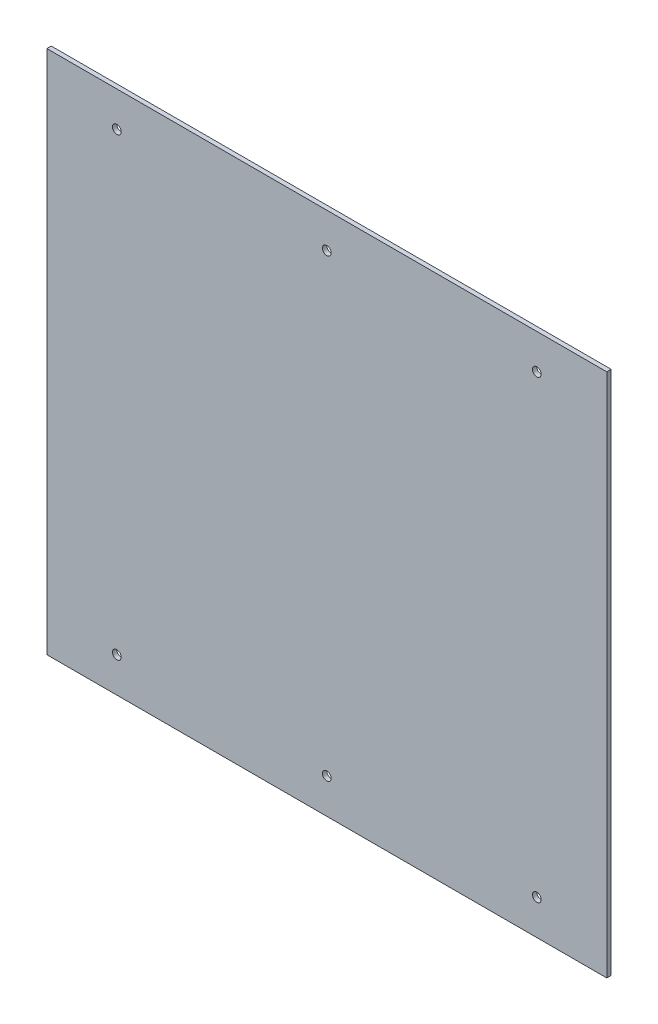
ISO-10303-21;
HEADER;
FILE_DESCRIPTION(('STEP AP214'),'2;1');
FILE_NAME('part.step','',(''),(''),'','','');
FILE_SCHEMA(('AUTOMOTIVE_DESIGN { 1 0 10303 214 1 1 1 1 }'));
ENDSEC;
DATA;
#1=APPLICATION_CONTEXT('core data for automotive mechanical design processes');
#2=APPLICATION_PROTOCOL_DEFINITION('international standard','automotive_design',2000,#1);
#3=PRODUCT_CONTEXT('',#1,'mechanical');
#4=PRODUCT('Part','Part','',(#3));
#5=PRODUCT_RELATED_PRODUCT_CATEGORY('part','',(#4));
#6=PRODUCT_DEFINITION_FORMATION('','',#4);
#7=PRODUCT_DEFINITION_CONTEXT('part definition',#1,'design');
#8=PRODUCT_DEFINITION('design','',#6,#7);
#9=PRODUCT_DEFINITION_SHAPE('','',#8);
#10=(LENGTH_UNIT() NAMED_UNIT(*) SI_UNIT(.MILLI.,.METRE.));
#11=(NAMED_UNIT(*) PLANE_ANGLE_UNIT() SI_UNIT($,.RADIAN.));
#12=(NAMED_UNIT(*) SI_UNIT($,.STERADIAN.) SOLID_ANGLE_UNIT());
#13=UNCERTAINTY_MEASURE_WITH_UNIT(LENGTH_MEASURE(1.E-05),#10,'distance_accuracy_value','');
#14=(GEOMETRIC_REPRESENTATION_CONTEXT(3) GLOBAL_UNCERTAINTY_ASSIGNED_CONTEXT((#13)) GLOBAL_UNIT_ASSIGNED_CONTEXT((#10,
#11,#12)) REPRESENTATION_CONTEXT('',''));
#15=CARTESIAN_POINT('',(0.,0.,0.));
#16=DIRECTION('',(0.,0.,1.));
#17=DIRECTION('',(1.,0.,0.));
#18=AXIS2_PLACEMENT_3D('',#15,#16,#17);
#19=CARTESIAN_POINT('',(0.,0.,1.5875));
#20=DIRECTION('',(0.,0.,1.));
#21=DIRECTION('',(1.,0.,0.));
#22=AXIS2_PLACEMENT_3D('',#19,#20,#21);
#23=PLANE('',#22);
#24=CARTESIAN_POINT('',(0.,76.2,1.5875));
#25=DIRECTION('',(0.,0.,1.));
#26=DIRECTION('',(1.,0.,0.));
#27=AXIS2_PLACEMENT_3D('',#24,#25,#26);
#28=CIRCLE('',#27,1.5875);
#29=CARTESIAN_POINT('',(1.5875,76.2,1.5875));
#30=VERTEX_POINT('',#29);
#31=EDGE_CURVE('E133',#30,#30,#28,.T.);
#32=ORIENTED_EDGE('',*,*,#31,.F.);
#33=EDGE_LOOP('',(#32));
#34=FACE_BOUND('',#33,.T.);
#35=CARTESIAN_POINT('',(-76.2,-88.9,1.5875));
#36=DIRECTION('',(0.,0.,1.));
#37=DIRECTION('',(1.,0.,0.));
#38=AXIS2_PLACEMENT_3D('',#35,#36,#37);
#39=CIRCLE('',#38,1.5875);
#40=CARTESIAN_POINT('',(-74.6125,-88.9,1.5875));
#41=VERTEX_POINT('',#40);
#42=EDGE_CURVE('E121',#41,#41,#39,.T.);
#43=ORIENTED_EDGE('',*,*,#42,.F.);
#44=EDGE_LOOP('',(#43));
#45=FACE_BOUND('',#44,.T.);
#46=CARTESIAN_POINT('',(76.2,-88.9,1.5875));
#47=DIRECTION('',(0.,0.,1.));
#48=DIRECTION('',(1.,0.,0.));
#49=AXIS2_PLACEMENT_3D('',#46,#47,#48);
#50=CIRCLE('',#49,1.58749999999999);
#51=CARTESIAN_POINT('',(77.7875,-88.9,1.5875));
#52=VERTEX_POINT('',#51);
#53=EDGE_CURVE('E100',#52,#52,#50,.T.);
#54=ORIENTED_EDGE('',*,*,#53,.F.);
#55=EDGE_LOOP('',(#54));
#56=FACE_BOUND('',#55,.T.);
#57=DIRECTION('',(0.,-1.,0.));
#58=VECTOR('',#57,1.);
#59=CARTESIAN_POINT('',(-101.6,-101.6,1.5875));
#60=LINE('',#59,#58);
#61=CARTESIAN_POINT('',(-101.6,88.9,1.5875));
#62=VERTEX_POINT('',#61);
#63=CARTESIAN_POINT('',(-101.6,-101.6,1.5875));
#64=VERTEX_POINT('',#63);
#65=EDGE_CURVE('E85',#62,#64,#60,.T.);
#66=ORIENTED_EDGE('',*,*,#65,.T.);
#67=DIRECTION('',(1.,0.,0.));
#68=VECTOR('',#67,1.);
#69=CARTESIAN_POINT('',(101.6,-101.6,1.5875));
#70=LINE('',#69,#68);
#71=CARTESIAN_POINT('',(101.6,-101.6,1.5875));
#72=VERTEX_POINT('',#71);
#73=EDGE_CURVE('E80',#64,#72,#70,.T.);
#74=ORIENTED_EDGE('',*,*,#73,.T.);
#75=DIRECTION('',(0.,1.,0.));
#76=VECTOR('',#75,1.);
#77=CARTESIAN_POINT('',(101.6,-101.6,1.5875));
#78=LINE('',#77,#76);
#79=CARTESIAN_POINT('',(101.6,88.9,1.5875));
#80=VERTEX_POINT('',#79);
#81=EDGE_CURVE('E83',#72,#80,#78,.T.);
#82=ORIENTED_EDGE('',*,*,#81,.T.);
#83=DIRECTION('',(-1.,0.,0.));
#84=VECTOR('',#83,1.);
#85=CARTESIAN_POINT('',(101.6,88.9,1.5875));
#86=LINE('',#85,#84);
#87=EDGE_CURVE('E50',#80,#62,#86,.T.);
#88=ORIENTED_EDGE('',*,*,#87,.T.);
#89=EDGE_LOOP('',(#66,#74,#82,#88));
#90=FACE_BOUND('',#89,.T.);
#91=CARTESIAN_POINT('',(0.,-88.9,1.5875));
#92=DIRECTION('',(0.,0.,1.));
#93=DIRECTION('',(1.,0.,0.));
#94=AXIS2_PLACEMENT_3D('',#91,#92,#93);
#95=CIRCLE('',#94,1.5875);
#96=CARTESIAN_POINT('',(1.58750000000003,-88.9,1.5875));
#97=VERTEX_POINT('',#96);
#98=EDGE_CURVE('E115',#97,#97,#95,.T.);
#99=ORIENTED_EDGE('',*,*,#98,.F.);
#100=EDGE_LOOP('',(#99));
#101=FACE_BOUND('',#100,.T.);
#102=CARTESIAN_POINT('',(-76.2,76.1999999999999,1.5875));
#103=DIRECTION('',(0.,0.,1.));
#104=DIRECTION('',(1.,0.,0.));
#105=AXIS2_PLACEMENT_3D('',#102,#103,#104);
#106=CIRCLE('',#105,1.58749999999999);
#107=CARTESIAN_POINT('',(-74.6125,76.1999999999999,1.5875));
#108=VERTEX_POINT('',#107);
#109=EDGE_CURVE('E127',#108,#108,#106,.T.);
#110=ORIENTED_EDGE('',*,*,#109,.F.);
#111=EDGE_LOOP('',(#110));
#112=FACE_BOUND('',#111,.T.);
#113=CARTESIAN_POINT('',(76.2,76.2,1.5875));
#114=DIRECTION('',(0.,0.,1.));
#115=DIRECTION('',(1.,0.,0.));
#116=AXIS2_PLACEMENT_3D('',#113,#114,#115);
#117=CIRCLE('',#116,1.58749999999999);
#118=CARTESIAN_POINT('',(77.7875,76.2,1.5875));
#119=VERTEX_POINT('',#118);
#120=EDGE_CURVE('E139',#119,#119,#117,.T.);
#121=ORIENTED_EDGE('',*,*,#120,.F.);
#122=EDGE_LOOP('',(#121));
#123=FACE_BOUND('',#122,.T.);
#124=ADVANCED_FACE('F33',(#34,#45,#56,#90,#101,#112,#123),#23,.T.);
#125=CARTESIAN_POINT('',(0.,0.,0.));
#126=DIRECTION('',(0.,0.,1.));
#127=DIRECTION('',(1.,0.,0.));
#128=AXIS2_PLACEMENT_3D('',#125,#126,#127);
#129=PLANE('',#128);
#130=DIRECTION('',(0.,-1.,0.));
#131=VECTOR('',#130,1.);
#132=CARTESIAN_POINT('',(-101.6,-101.6,0.));
#133=LINE('',#132,#131);
#134=CARTESIAN_POINT('',(-101.6,88.9,0.));
#135=VERTEX_POINT('',#134);
#136=CARTESIAN_POINT('',(-101.6,-101.6,0.));
#137=VERTEX_POINT('',#136);
#138=EDGE_CURVE('E97',#135,#137,#133,.T.);
#139=ORIENTED_EDGE('',*,*,#138,.F.);
#140=DIRECTION('',(-1.,0.,0.));
#141=VECTOR('',#140,1.);
#142=CARTESIAN_POINT('',(101.6,88.9,0.));
#143=LINE('',#142,#141);
#144=CARTESIAN_POINT('',(101.6,88.9,0.));
#145=VERTEX_POINT('',#144);
#146=EDGE_CURVE('E73',#145,#135,#143,.T.);
#147=ORIENTED_EDGE('',*,*,#146,.F.);
#148=DIRECTION('',(0.,1.,0.));
#149=VECTOR('',#148,1.);
#150=CARTESIAN_POINT('',(101.6,-101.6,0.));
#151=LINE('',#150,#149);
#152=CARTESIAN_POINT('',(101.6,-101.6,0.));
#153=VERTEX_POINT('',#152);
#154=EDGE_CURVE('E67',#153,#145,#151,.T.);
#155=ORIENTED_EDGE('',*,*,#154,.F.);
#156=DIRECTION('',(1.,0.,0.));
#157=VECTOR('',#156,1.);
#158=CARTESIAN_POINT('',(101.6,-101.6,0.));
#159=LINE('',#158,#157);
#160=EDGE_CURVE('E89',#137,#153,#159,.T.);
#161=ORIENTED_EDGE('',*,*,#160,.F.);
#162=EDGE_LOOP('',(#139,#147,#155,#161));
#163=FACE_BOUND('',#162,.T.);
#164=CARTESIAN_POINT('',(76.2,-88.9,0.));
#165=DIRECTION('',(0.,0.,1.));
#166=DIRECTION('',(1.,0.,0.));
#167=AXIS2_PLACEMENT_3D('',#164,#165,#166);
#168=CIRCLE('',#167,1.58749999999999);
#169=CARTESIAN_POINT('',(77.7875,-88.9,0.));
#170=VERTEX_POINT('',#169);
#171=EDGE_CURVE('E112',#170,#170,#168,.T.);
#172=ORIENTED_EDGE('',*,*,#171,.T.);
#173=EDGE_LOOP('',(#172));
#174=FACE_BOUND('',#173,.T.);
#175=CARTESIAN_POINT('',(0.,-88.9,0.));
#176=DIRECTION('',(0.,0.,1.));
#177=DIRECTION('',(1.,0.,0.));
#178=AXIS2_PLACEMENT_3D('',#175,#176,#177);
#179=CIRCLE('',#178,1.5875);
#180=CARTESIAN_POINT('',(1.58750000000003,-88.9,0.));
#181=VERTEX_POINT('',#180);
#182=EDGE_CURVE('E118',#181,#181,#179,.T.);
#183=ORIENTED_EDGE('',*,*,#182,.T.);
#184=EDGE_LOOP('',(#183));
#185=FACE_BOUND('',#184,.T.);
#186=CARTESIAN_POINT('',(-76.2,-88.9,0.));
#187=DIRECTION('',(0.,0.,1.));
#188=DIRECTION('',(1.,0.,0.));
#189=AXIS2_PLACEMENT_3D('',#186,#187,#188);
#190=CIRCLE('',#189,1.5875);
#191=CARTESIAN_POINT('',(-74.6125,-88.9,0.));
#192=VERTEX_POINT('',#191);
#193=EDGE_CURVE('E124',#192,#192,#190,.T.);
#194=ORIENTED_EDGE('',*,*,#193,.T.);
#195=EDGE_LOOP('',(#194));
#196=FACE_BOUND('',#195,.T.);
#197=CARTESIAN_POINT('',(-76.2,76.1999999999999,0.));
#198=DIRECTION('',(0.,0.,1.));
#199=DIRECTION('',(1.,0.,0.));
#200=AXIS2_PLACEMENT_3D('',#197,#198,#199);
#201=CIRCLE('',#200,1.58749999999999);
#202=CARTESIAN_POINT('',(-74.6125,76.1999999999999,0.));
#203=VERTEX_POINT('',#202);
#204=EDGE_CURVE('E130',#203,#203,#201,.T.);
#205=ORIENTED_EDGE('',*,*,#204,.T.);
#206=EDGE_LOOP('',(#205));
#207=FACE_BOUND('',#206,.T.);
#208=CARTESIAN_POINT('',(0.,76.2,0.));
#209=DIRECTION('',(0.,0.,1.));
#210=DIRECTION('',(1.,0.,0.));
#211=AXIS2_PLACEMENT_3D('',#208,#209,#210);
#212=CIRCLE('',#211,1.5875);
#213=CARTESIAN_POINT('',(1.5875,76.2,0.));
#214=VERTEX_POINT('',#213);
#215=EDGE_CURVE('E136',#214,#214,#212,.T.);
#216=ORIENTED_EDGE('',*,*,#215,.T.);
#217=EDGE_LOOP('',(#216));
#218=FACE_BOUND('',#217,.T.);
#219=CARTESIAN_POINT('',(76.2,76.2,0.));
#220=DIRECTION('',(0.,0.,1.));
#221=DIRECTION('',(1.,0.,0.));
#222=AXIS2_PLACEMENT_3D('',#219,#220,#221);
#223=CIRCLE('',#222,1.58749999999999);
#224=CARTESIAN_POINT('',(77.7875,76.2,0.));
#225=VERTEX_POINT('',#224);
#226=EDGE_CURVE('E142',#225,#225,#223,.T.);
#227=ORIENTED_EDGE('',*,*,#226,.T.);
#228=EDGE_LOOP('',(#227));
#229=FACE_BOUND('',#228,.T.);
#230=ADVANCED_FACE('F108',(#163,#174,#185,#196,#207,#218,#229),#129,.F.);
#231=CARTESIAN_POINT('',(-101.6,-101.6,1.5875));
#232=DIRECTION('',(1.,0.,0.));
#233=DIRECTION('',(0.,0.,-1.));
#234=AXIS2_PLACEMENT_3D('',#231,#232,#233);
#235=PLANE('',#234);
#236=ORIENTED_EDGE('',*,*,#138,.T.);
#237=DIRECTION('',(0.,0.,-1.));
#238=VECTOR('',#237,1.);
#239=CARTESIAN_POINT('',(-101.6,-101.6,1.5875));
#240=LINE('',#239,#238);
#241=EDGE_CURVE('E11',#64,#137,#240,.T.);
#242=ORIENTED_EDGE('',*,*,#241,.F.);
#243=ORIENTED_EDGE('',*,*,#65,.F.);
#244=DIRECTION('',(0.,0.,-1.));
#245=VECTOR('',#244,1.);
#246=CARTESIAN_POINT('',(-101.6,88.9,1.5875));
#247=LINE('',#246,#245);
#248=EDGE_CURVE('E93',#62,#135,#247,.T.);
#249=ORIENTED_EDGE('',*,*,#248,.T.);
#250=EDGE_LOOP('',(#236,#242,#243,#249));
#251=FACE_BOUND('',#250,.T.);
#252=ADVANCED_FACE('F35',(#251),#235,.F.);
#253=CARTESIAN_POINT('',(101.6,-101.6,1.5875));
#254=DIRECTION('',(0.,1.,0.));
#255=DIRECTION('',(0.,0.,1.));
#256=AXIS2_PLACEMENT_3D('',#253,#254,#255);
#257=PLANE('',#256);
#258=ORIENTED_EDGE('',*,*,#160,.T.);
#259=DIRECTION('',(0.,0.,-1.));
#260=VECTOR('',#259,1.);
#261=CARTESIAN_POINT('',(101.6,-101.6,1.5875));
#262=LINE('',#261,#260);
#263=EDGE_CURVE('E42',#72,#153,#262,.T.);
#264=ORIENTED_EDGE('',*,*,#263,.F.);
#265=ORIENTED_EDGE('',*,*,#73,.F.);
#266=ORIENTED_EDGE('',*,*,#241,.T.);
#267=EDGE_LOOP('',(#258,#264,#265,#266));
#268=FACE_BOUND('',#267,.T.);
#269=ADVANCED_FACE('F88',(#268),#257,.F.);
#270=CARTESIAN_POINT('',(101.6,-101.6,1.5875));
#271=DIRECTION('',(-1.,0.,0.));
#272=DIRECTION('',(0.,0.,1.));
#273=AXIS2_PLACEMENT_3D('',#270,#271,#272);
#274=PLANE('',#273);
#275=ORIENTED_EDGE('',*,*,#154,.T.);
#276=DIRECTION('',(0.,0.,-1.));
#277=VECTOR('',#276,1.);
#278=CARTESIAN_POINT('',(101.6,88.9,1.5875));
#279=LINE('',#278,#277);
#280=EDGE_CURVE('E90',#80,#145,#279,.T.);
#281=ORIENTED_EDGE('',*,*,#280,.F.);
#282=ORIENTED_EDGE('',*,*,#81,.F.);
#283=ORIENTED_EDGE('',*,*,#263,.T.);
#284=EDGE_LOOP('',(#275,#281,#282,#283));
#285=FACE_BOUND('',#284,.T.);
#286=ADVANCED_FACE('F91',(#285),#274,.F.);
#287=CARTESIAN_POINT('',(101.6,88.9,1.5875));
#288=DIRECTION('',(0.,-1.,0.));
#289=DIRECTION('',(0.,0.,-1.));
#290=AXIS2_PLACEMENT_3D('',#287,#288,#289);
#291=PLANE('',#290);
#292=ORIENTED_EDGE('',*,*,#146,.T.);
#293=ORIENTED_EDGE('',*,*,#248,.F.);
#294=ORIENTED_EDGE('',*,*,#87,.F.);
#295=ORIENTED_EDGE('',*,*,#280,.T.);
#296=EDGE_LOOP('',(#292,#293,#294,#295));
#297=FACE_BOUND('',#296,.T.);
#298=ADVANCED_FACE('F105',(#297),#291,.F.);
#299=CARTESIAN_POINT('',(76.2,-88.9,1.5875));
#300=DIRECTION('',(0.,0.,-1.));
#301=DIRECTION('',(-1.,0.,0.));
#302=AXIS2_PLACEMENT_3D('',#299,#300,#301);
#303=CYLINDRICAL_SURFACE('',#302,1.58749999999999);
#304=ORIENTED_EDGE('',*,*,#53,.T.);
#305=EDGE_LOOP('',(#304));
#306=FACE_BOUND('',#305,.T.);
#307=ORIENTED_EDGE('',*,*,#171,.F.);
#308=EDGE_LOOP('',(#307));
#309=FACE_BOUND('',#308,.T.);
#310=ADVANCED_FACE('F161',(#306,#309),#303,.F.);
#311=CARTESIAN_POINT('',(0.,-88.9,1.5875));
#312=DIRECTION('',(0.,0.,-1.));
#313=DIRECTION('',(-1.,0.,0.));
#314=AXIS2_PLACEMENT_3D('',#311,#312,#313);
#315=CYLINDRICAL_SURFACE('',#314,1.5875);
#316=ORIENTED_EDGE('',*,*,#98,.T.);
#317=EDGE_LOOP('',(#316));
#318=FACE_BOUND('',#317,.T.);
#319=ORIENTED_EDGE('',*,*,#182,.F.);
#320=EDGE_LOOP('',(#319));
#321=FACE_BOUND('',#320,.T.);
#322=ADVANCED_FACE('F207',(#318,#321),#315,.F.);
#323=CARTESIAN_POINT('',(-76.2,-88.9,1.5875));
#324=DIRECTION('',(0.,0.,-1.));
#325=DIRECTION('',(-1.,0.,0.));
#326=AXIS2_PLACEMENT_3D('',#323,#324,#325);
#327=CYLINDRICAL_SURFACE('',#326,1.5875);
#328=ORIENTED_EDGE('',*,*,#42,.T.);
#329=EDGE_LOOP('',(#328));
#330=FACE_BOUND('',#329,.T.);
#331=ORIENTED_EDGE('',*,*,#193,.F.);
#332=EDGE_LOOP('',(#331));
#333=FACE_BOUND('',#332,.T.);
#334=ADVANCED_FACE('F215',(#330,#333),#327,.F.);
#335=CARTESIAN_POINT('',(-76.2,76.1999999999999,1.5875));
#336=DIRECTION('',(0.,0.,-1.));
#337=DIRECTION('',(-1.,0.,0.));
#338=AXIS2_PLACEMENT_3D('',#335,#336,#337);
#339=CYLINDRICAL_SURFACE('',#338,1.58749999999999);
#340=ORIENTED_EDGE('',*,*,#109,.T.);
#341=EDGE_LOOP('',(#340));
#342=FACE_BOUND('',#341,.T.);
#343=ORIENTED_EDGE('',*,*,#204,.F.);
#344=EDGE_LOOP('',(#343));
#345=FACE_BOUND('',#344,.T.);
#346=ADVANCED_FACE('F223',(#342,#345),#339,.F.);
#347=CARTESIAN_POINT('',(0.,76.2,1.5875));
#348=DIRECTION('',(0.,0.,-1.));
#349=DIRECTION('',(-1.,0.,0.));
#350=AXIS2_PLACEMENT_3D('',#347,#348,#349);
#351=CYLINDRICAL_SURFACE('',#350,1.5875);
#352=ORIENTED_EDGE('',*,*,#31,.T.);
#353=EDGE_LOOP('',(#352));
#354=FACE_BOUND('',#353,.T.);
#355=ORIENTED_EDGE('',*,*,#215,.F.);
#356=EDGE_LOOP('',(#355));
#357=FACE_BOUND('',#356,.T.);
#358=ADVANCED_FACE('F232',(#354,#357),#351,.F.);
#359=CARTESIAN_POINT('',(76.2,76.2,1.5875));
#360=DIRECTION('',(0.,0.,-1.));
#361=DIRECTION('',(-1.,0.,0.));
#362=AXIS2_PLACEMENT_3D('',#359,#360,#361);
#363=CYLINDRICAL_SURFACE('',#362,1.58749999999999);
#364=ORIENTED_EDGE('',*,*,#120,.T.);
#365=EDGE_LOOP('',(#364));
#366=FACE_BOUND('',#365,.T.);
#367=ORIENTED_EDGE('',*,*,#226,.F.);
#368=EDGE_LOOP('',(#367));
#369=FACE_BOUND('',#368,.T.);
#370=ADVANCED_FACE('F148',(#366,#369),#363,.F.);
#371=CLOSED_SHELL('',(#124,#230,#252,#269,#286,#298,#310,#322,#334,#346,#358,#370));
#372=MANIFOLD_SOLID_BREP('B2',#371);
#373=ADVANCED_BREP_SHAPE_REPRESENTATION('',(#18,#372),#14);
#374=SHAPE_DEFINITION_REPRESENTATION(#9,#373);
ENDSEC;
END-ISO-10303-21;
